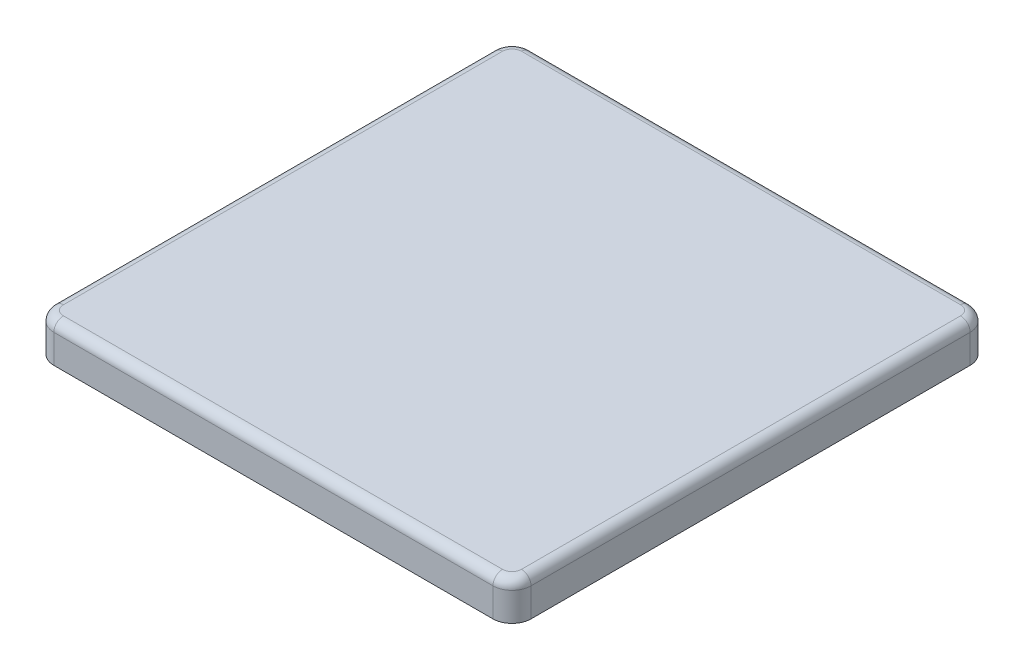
from build123d import *

# Parameters (mm, degrees)
EXTRUDE_1_DEPTH     = 2
FILLET_1_R          = 1
CUT_EXTRUDE_2_DEPTH = 2
SKETCH_3_W          = 1.8
SKETCH_3_H          = 8
EXTRUDE_3_DEPTH     = 4
EXTRUDE_4_DEPTH     = 11
EXTRUDE_4_TAPER     = 0.5
FILLET_2_R          = 0.8


with BuildPart() as part:
    # Sketch 1 → Extrude 1 (new, symmetric)
    with BuildSketch(Plane(origin=(0, 0, 0), x_dir=(0, 0, -1), z_dir=(0, 1, 0))):
        with BuildLine():
            Line((-23, 25), (23, 25))
            ThreePointArc((23, 25), (24.414213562, 24.414213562), (25, 23))
            Line((25, 23), (25, -23))
            ThreePointArc((25, -23), (24.414213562, -24.414213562), (23, -25))
            Line((23, -25), (-23, -25))
            ThreePointArc((-23, -25), (-24.414213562, -24.414213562), (-25, -23))
            Line((-25, -23), (-25, 23))
            ThreePointArc((-25, 23), (-24.414213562, 24.414213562), (-23, 25))
        make_face()
    extrude(amount=EXTRUDE_1_DEPTH, both=True)

    # Fillet 1
    fillet_1_edges = [part.edges().sort_by_distance(p)[0] for p in [
        (-24.414213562, 2, 24.414213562),
        (0, 2, 25),
        (24.414213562, 2, 24.414213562),
        (25, 2, 0),
        (24.414213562, 2, -24.414213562),
        (0, 2, -25),
        (-24.414213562, 2, -24.414213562),
        (-25, 2, 0),
    ]]
    fillet(fillet_1_edges, radius=FILLET_1_R)

    # Sketch 2 → Cut-Extrude 2 (cut)
    with BuildSketch(Plane.XZ.offset(2)):
        with BuildLine():
            Line((-22.2, 23), (22.2, 23))
            ThreePointArc((22.2, 23), (22.765685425, 22.765685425), (23, 22.2))
            Line((23, 22.2), (23, -22.2))
            ThreePointArc((23, -22.2), (22.765685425, -22.765685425), (22.2, -23))
            Line((22.2, -23), (-22.2, -23))
            ThreePointArc((-22.2, -23), (-22.765685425, -22.765685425), (-23, -22.2))
            Line((-23, -22.2), (-23, 22.2))
            ThreePointArc((-23, 22.2), (-22.765685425, 22.765685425), (-22.2, 23))
        make_face()
    extrude(amount=-CUT_EXTRUDE_2_DEPTH, mode=Mode.SUBTRACT)

    # Sketch 3 → Extrude 3 (add)
    with BuildSketch(Plane.XZ):
        with Locations((-22.1, 0)):
            Rectangle(SKETCH_3_W, SKETCH_3_H)
    extrude(amount=EXTRUDE_3_DEPTH)

    # Sketch 4 → Extrude 4 (add)
    with BuildSketch(Plane.XZ):
        Polygon((-3.74766594, 0.707106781), (0.707106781, -3.74766594), (3.74766594, -0.707106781), (-0.707106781, 3.74766594), align=None)
    extrude(amount=EXTRUDE_4_DEPTH, taper=EXTRUDE_4_TAPER)

    # Fillet 2
    fillet_2_edges = [part.edges().sort_by_distance(p)[0] for p in [
        (-1.452400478, -11, -1.452400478),
        (2.159507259, -11, -2.159507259),
        (1.452400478, -11, 1.452400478),
        (-2.159507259, -11, 2.159507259),
    ]]
    fillet(fillet_2_edges, radius=FILLET_2_R)


solid = part.part
